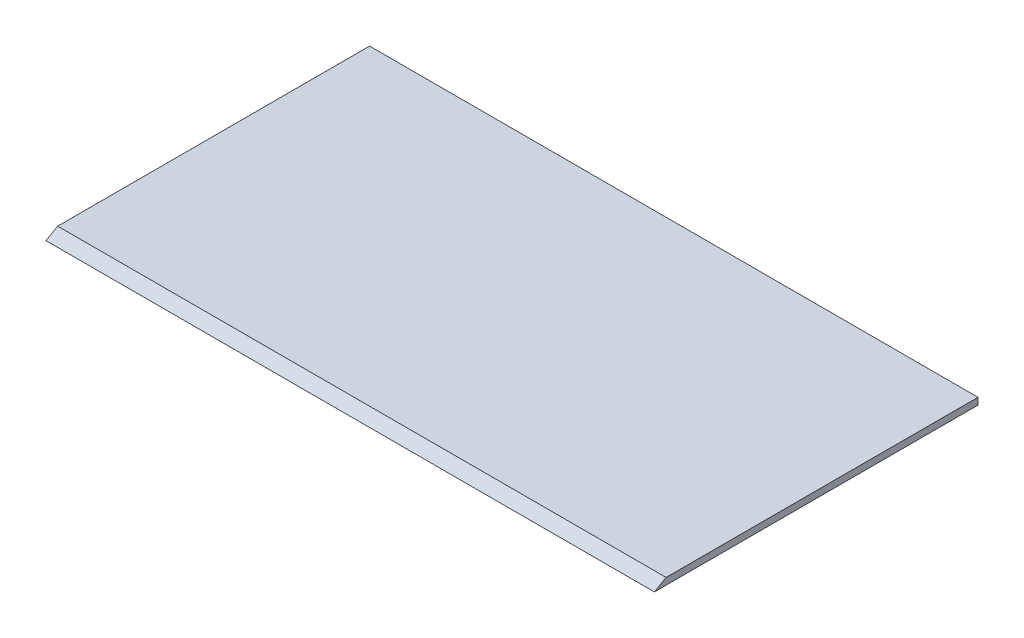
from build123d import *

# Parameters (mm, degrees)
SKETCH1_W      = 1146.175
SKETCH1_H      = 609.6
EXTRUDE1_DEPTH = 6.35
EXTRUDE2_DEPTH = 1187.027189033


with BuildPart() as part:
    # Sketch1 → Extrude1 (new, symmetric)
    with BuildSketch(Plane(origin=(0, 0, 0), x_dir=(1, 0, 0), z_dir=(0, 1, 0))):
        Rectangle(SKETCH1_W, SKETCH1_H)
    extrude(amount=EXTRUDE1_DEPTH, both=True)

    # Sketch2 → Extrude2 (cut, through all)
    with BuildSketch(Plane(origin=(573.0875, 0, 0), x_dir=(0, 0, -1), z_dir=(1, 0, 0))):
        Polygon((-304.8, 6.35), (-304.8, -6.35), (-282.802954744, 6.35), align=None)
    extrude(amount=-EXTRUDE2_DEPTH, mode=Mode.SUBTRACT)


solid = part.part
